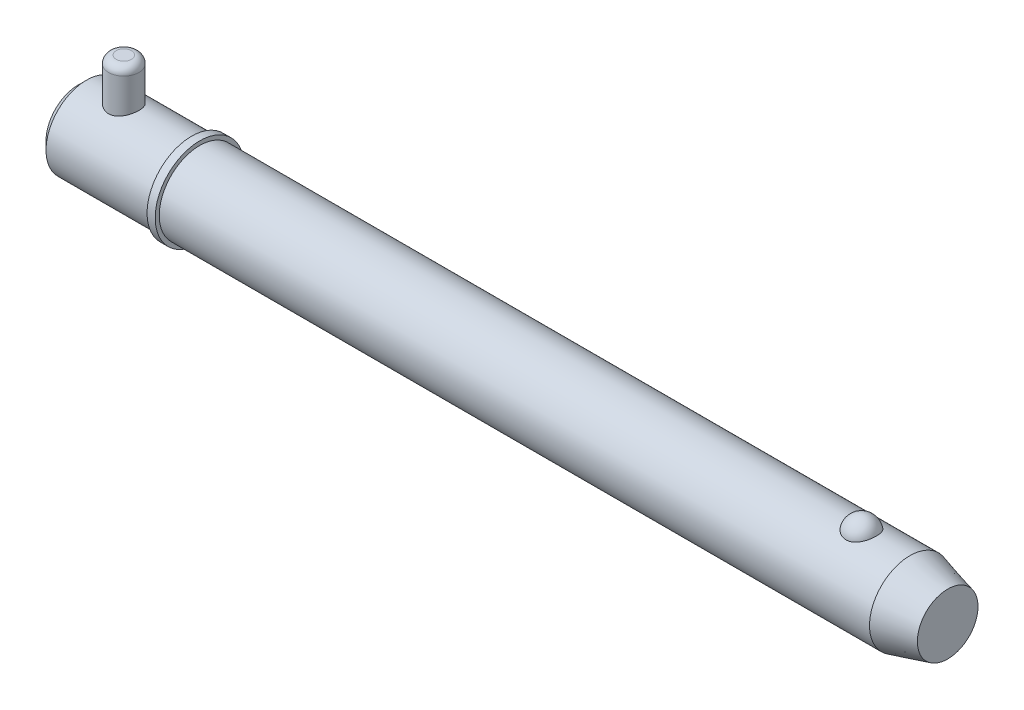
ISO-10303-21;
HEADER;
FILE_DESCRIPTION(('STEP AP214'),'2;1');
FILE_NAME('part.step','',(''),(''),'','','');
FILE_SCHEMA(('AUTOMOTIVE_DESIGN { 1 0 10303 214 1 1 1 1 }'));
ENDSEC;
DATA;
#1=APPLICATION_CONTEXT('core data for automotive mechanical design processes');
#2=APPLICATION_PROTOCOL_DEFINITION('international standard','automotive_design',2000,#1);
#3=PRODUCT_CONTEXT('',#1,'mechanical');
#4=PRODUCT('Part','Part','',(#3));
#5=PRODUCT_RELATED_PRODUCT_CATEGORY('part','',(#4));
#6=PRODUCT_DEFINITION_FORMATION('','',#4);
#7=PRODUCT_DEFINITION_CONTEXT('part definition',#1,'design');
#8=PRODUCT_DEFINITION('design','',#6,#7);
#9=PRODUCT_DEFINITION_SHAPE('','',#8);
#10=(LENGTH_UNIT() NAMED_UNIT(*) SI_UNIT(.MILLI.,.METRE.));
#11=(NAMED_UNIT(*) PLANE_ANGLE_UNIT() SI_UNIT($,.RADIAN.));
#12=(NAMED_UNIT(*) SI_UNIT($,.STERADIAN.) SOLID_ANGLE_UNIT());
#13=UNCERTAINTY_MEASURE_WITH_UNIT(LENGTH_MEASURE(1.E-05),#10,'distance_accuracy_value','');
#14=(GEOMETRIC_REPRESENTATION_CONTEXT(3) GLOBAL_UNCERTAINTY_ASSIGNED_CONTEXT((#13)) GLOBAL_UNIT_ASSIGNED_CONTEXT((#10,
#11,#12)) REPRESENTATION_CONTEXT('',''));
#15=CARTESIAN_POINT('',(0.,0.,0.));
#16=DIRECTION('',(0.,0.,1.));
#17=DIRECTION('',(1.,0.,0.));
#18=AXIS2_PLACEMENT_3D('',#15,#16,#17);
#19=CARTESIAN_POINT('',(14.28,25.4,0.));
#20=DIRECTION('',(0.,-1.,0.));
#21=DIRECTION('',(0.,0.,-1.));
#22=AXIS2_PLACEMENT_3D('',#19,#20,#21);
#23=CYLINDRICAL_SURFACE('',#22,4.76);
#24=CARTESIAN_POINT('',(14.28,-10.32,0.));
#25=DIRECTION('',(0.,1.,0.));
#26=DIRECTION('',(0.,0.,1.));
#27=AXIS2_PLACEMENT_3D('',#24,#25,#26);
#28=CIRCLE('',#27,4.76);
#29=CARTESIAN_POINT('',(14.28,-10.32,-4.76));
#30=VERTEX_POINT('',#29);
#31=EDGE_CURVE('P0_E25',#30,#30,#28,.T.);
#32=CARTESIAN_POINT('',(14.28,23.02,0.));
#33=DIRECTION('',(0.,1.,0.));
#34=DIRECTION('',(0.,0.,1.));
#35=AXIS2_PLACEMENT_3D('',#32,#33,#34);
#36=CIRCLE('',#35,4.76);
#37=CARTESIAN_POINT('',(14.28,23.02,-4.76));
#38=VERTEX_POINT('',#37);
#39=EDGE_CURVE('P0_E29',#38,#38,#36,.F.);
#40=CARTESIAN_POINT('',(14.28,-10.32,-4.76));
#41=CARTESIAN_POINT('',(14.28,-9.97270833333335,-4.76));
#42=CARTESIAN_POINT('',(14.28,-9.62541666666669,-4.76));
#43=CARTESIAN_POINT('',(14.28,-8.93083333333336,-4.76));
#44=CARTESIAN_POINT('',(14.28,-8.58354166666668,-4.76));
#45=CARTESIAN_POINT('',(14.28,-7.88895833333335,-4.76));
#46=CARTESIAN_POINT('',(14.28,-7.54166666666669,-4.76));
#47=CARTESIAN_POINT('',(14.28,-6.84708333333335,-4.76));
#48=CARTESIAN_POINT('',(14.28,-6.49979166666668,-4.76));
#49=CARTESIAN_POINT('',(14.28,-5.80520833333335,-4.76));
#50=CARTESIAN_POINT('',(14.28,-5.45791666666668,-4.76));
#51=CARTESIAN_POINT('',(14.28,-4.76333333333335,-4.76));
#52=CARTESIAN_POINT('',(14.28,-4.41604166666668,-4.76));
#53=CARTESIAN_POINT('',(14.28,-3.72145833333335,-4.76));
#54=CARTESIAN_POINT('',(14.28,-3.37416666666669,-4.76));
#55=CARTESIAN_POINT('',(14.28,-2.67958333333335,-4.76));
#56=CARTESIAN_POINT('',(14.28,-2.33229166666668,-4.76));
#57=CARTESIAN_POINT('',(14.28,-1.63770833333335,-4.76));
#58=CARTESIAN_POINT('',(14.28,-1.29041666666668,-4.76));
#59=CARTESIAN_POINT('',(14.28,-0.595833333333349,-4.76));
#60=CARTESIAN_POINT('',(14.28,-0.24854166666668,-4.76));
#61=CARTESIAN_POINT('',(14.28,0.446041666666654,-4.76));
#62=CARTESIAN_POINT('',(14.28,0.793333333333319,-4.76));
#63=CARTESIAN_POINT('',(14.28,1.48791666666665,-4.76));
#64=CARTESIAN_POINT('',(14.28,1.83520833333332,-4.76));
#65=CARTESIAN_POINT('',(14.28,2.52979166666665,-4.76));
#66=CARTESIAN_POINT('',(14.28,2.87708333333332,-4.76));
#67=CARTESIAN_POINT('',(14.28,3.57166666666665,-4.76));
#68=CARTESIAN_POINT('',(14.28,3.91895833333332,-4.76));
#69=CARTESIAN_POINT('',(14.28,4.61354166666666,-4.76));
#70=CARTESIAN_POINT('',(14.28,4.96083333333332,-4.76));
#71=CARTESIAN_POINT('',(14.28,5.65541666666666,-4.76));
#72=CARTESIAN_POINT('',(14.28,6.00270833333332,-4.76));
#73=CARTESIAN_POINT('',(14.28,6.69729166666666,-4.76));
#74=CARTESIAN_POINT('',(14.28,7.04458333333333,-4.76));
#75=CARTESIAN_POINT('',(14.28,7.73916666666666,-4.76));
#76=CARTESIAN_POINT('',(14.28,8.08645833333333,-4.76));
#77=CARTESIAN_POINT('',(14.28,8.78104166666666,-4.76));
#78=CARTESIAN_POINT('',(14.28,9.12833333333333,-4.76));
#79=CARTESIAN_POINT('',(14.28,9.82291666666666,-4.76));
#80=CARTESIAN_POINT('',(14.28,10.1702083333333,-4.76));
#81=CARTESIAN_POINT('',(14.28,10.8647916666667,-4.76));
#82=CARTESIAN_POINT('',(14.28,11.2120833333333,-4.76));
#83=CARTESIAN_POINT('',(14.28,11.9066666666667,-4.76));
#84=CARTESIAN_POINT('',(14.28,12.2539583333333,-4.76));
#85=CARTESIAN_POINT('',(14.28,12.9485416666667,-4.76));
#86=CARTESIAN_POINT('',(14.28,13.2958333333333,-4.76));
#87=CARTESIAN_POINT('',(14.28,13.9904166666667,-4.76));
#88=CARTESIAN_POINT('',(14.28,14.3377083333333,-4.76));
#89=CARTESIAN_POINT('',(14.28,15.0322916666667,-4.76));
#90=CARTESIAN_POINT('',(14.28,15.3795833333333,-4.76));
#91=CARTESIAN_POINT('',(14.28,16.0741666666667,-4.76));
#92=CARTESIAN_POINT('',(14.28,16.4214583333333,-4.76));
#93=CARTESIAN_POINT('',(14.28,17.1160416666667,-4.76));
#94=CARTESIAN_POINT('',(14.28,17.4633333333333,-4.76));
#95=CARTESIAN_POINT('',(14.28,18.1579166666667,-4.76));
#96=CARTESIAN_POINT('',(14.28,18.5052083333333,-4.76));
#97=CARTESIAN_POINT('',(14.28,19.1997916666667,-4.76));
#98=CARTESIAN_POINT('',(14.28,19.5470833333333,-4.76));
#99=CARTESIAN_POINT('',(14.28,20.2416666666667,-4.76));
#100=CARTESIAN_POINT('',(14.28,20.5889583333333,-4.76));
#101=CARTESIAN_POINT('',(14.28,21.2835416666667,-4.76));
#102=CARTESIAN_POINT('',(14.28,21.6308333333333,-4.76));
#103=CARTESIAN_POINT('',(14.28,22.3254166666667,-4.76));
#104=CARTESIAN_POINT('',(14.28,22.6727083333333,-4.76));
#105=CARTESIAN_POINT('',(14.28,23.02,-4.76));
#106=B_SPLINE_CURVE_WITH_KNOTS('',3,(#40,#41,#42,#43,#44,#45,#46,#47,#48,#49,#50,#51,#52,#53,
#54,#55,#56,#57,#58,#59,#60,#61,#62,#63,#64,#65,#66,#67,#68,#69,#70,#71,#72,#73,#74,#75,#76,#77,
#78,#79,#80,#81,#82,#83,#84,#85,#86,#87,#88,#89,#90,#91,#92,#93,#94,#95,#96,#97,#98,#99,#100,
#101,#102,#103,#104,#105),.UNSPECIFIED.,.F.,.F.,(4,2,2,2,2,2,2,2,2,2,2,2,2,2,2,2,2,2,2,2,2,2,2,
2,2,2,2,2,2,2,2,2,4),(0.,1.041875,2.08375,3.125625,4.1675,5.209375,6.25125,7.293125,
8.33500000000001,9.376875,10.41875,11.460625,12.5025,13.544375,14.58625,15.628125,16.67,
17.711875,18.75375,19.795625,20.8375,21.879375,22.92125,23.963125,25.005,26.046875,27.08875,
28.130625,29.1725,30.214375,31.25625,32.298125,33.34),.UNSPECIFIED.);
#107=EDGE_CURVE('P0_BSEAM14',#30,#38,#106,.T.);
#108=ORIENTED_EDGE('',*,*,#31,.T.);
#109=ORIENTED_EDGE('',*,*,#39,.T.);
#110=ORIENTED_EDGE('',*,*,#107,.T.);
#111=ORIENTED_EDGE('',*,*,#107,.F.);
#112=EDGE_LOOP('',(#108,#110,#109,#111));
#113=FACE_BOUND('',#112,.T.);
#114=ADVANCED_FACE('P0_F14',(#113),#23,.T.);
#115=CARTESIAN_POINT('',(14.28,25.4,0.));
#116=DIRECTION('',(0.,1.,0.));
#117=DIRECTION('',(0.,0.,1.));
#118=AXIS2_PLACEMENT_3D('',#115,#116,#117);
#119=PLANE('',#118);
#120=CARTESIAN_POINT('',(14.28,25.4,0.));
#121=DIRECTION('',(0.,1.,0.));
#122=DIRECTION('',(0.,0.,1.));
#123=AXIS2_PLACEMENT_3D('',#120,#121,#122);
#124=CIRCLE('',#123,2.38);
#125=CARTESIAN_POINT('',(14.28,25.4,2.38));
#126=VERTEX_POINT('',#125);
#127=EDGE_CURVE('P0_E10',#126,#126,#124,.T.);
#128=ORIENTED_EDGE('',*,*,#127,.T.);
#129=EDGE_LOOP('',(#128));
#130=FACE_BOUND('',#129,.T.);
#131=ADVANCED_FACE('P0_F46',(#130),#119,.T.);
#132=CARTESIAN_POINT('',(14.28,-12.7,0.));
#133=DIRECTION('',(0.,1.,0.));
#134=DIRECTION('',(0.,0.,1.));
#135=AXIS2_PLACEMENT_3D('',#132,#133,#134);
#136=PLANE('',#135);
#137=CARTESIAN_POINT('',(14.28,-12.7,0.));
#138=DIRECTION('',(0.,1.,0.));
#139=DIRECTION('',(0.,0.,1.));
#140=AXIS2_PLACEMENT_3D('',#137,#138,#139);
#141=CIRCLE('',#140,2.38);
#142=CARTESIAN_POINT('',(14.28,-12.7,2.38));
#143=VERTEX_POINT('',#142);
#144=EDGE_CURVE('P0_E21',#143,#143,#141,.F.);
#145=ORIENTED_EDGE('',*,*,#144,.T.);
#146=EDGE_LOOP('',(#145));
#147=FACE_BOUND('',#146,.T.);
#148=ADVANCED_FACE('P0_F43',(#147),#136,.F.);
#149=CARTESIAN_POINT('',(14.28,-10.32,0.));
#150=DIRECTION('',(0.,1.,0.));
#151=DIRECTION('',(0.,0.,1.));
#152=AXIS2_PLACEMENT_3D('',#149,#150,#151);
#153=DEGENERATE_TOROIDAL_SURFACE('',#152,2.38,2.38,.T.);
#154=ORIENTED_EDGE('',*,*,#144,.F.);
#155=EDGE_LOOP('',(#154));
#156=FACE_BOUND('',#155,.T.);
#157=ORIENTED_EDGE('',*,*,#31,.F.);
#158=EDGE_LOOP('',(#157));
#159=FACE_BOUND('',#158,.T.);
#160=ADVANCED_FACE('P0_F38',(#156,#159),#153,.T.);
#161=CARTESIAN_POINT('',(14.28,23.02,0.));
#162=DIRECTION('',(0.,1.,0.));
#163=DIRECTION('',(0.,0.,1.));
#164=AXIS2_PLACEMENT_3D('',#161,#162,#163);
#165=DEGENERATE_TOROIDAL_SURFACE('',#164,2.38,2.38,.T.);
#166=ORIENTED_EDGE('',*,*,#39,.F.);
#167=EDGE_LOOP('',(#166));
#168=FACE_BOUND('',#167,.T.);
#169=ORIENTED_EDGE('',*,*,#127,.F.);
#170=EDGE_LOOP('',(#169));
#171=FACE_BOUND('',#170,.T.);
#172=ADVANCED_FACE('P0_F16',(#168,#171),#165,.T.);
#173=CLOSED_SHELL('',(#114,#131,#148,#160,#172));
#174=MANIFOLD_SOLID_BREP('P0_B1',#173);
#175=CARTESIAN_POINT('',(0.,0.,0.));
#176=DIRECTION('',(1.,0.,0.));
#177=DIRECTION('',(0.,0.,-1.));
#178=AXIS2_PLACEMENT_3D('',#175,#176,#177);
#179=CYLINDRICAL_SURFACE('',#178,12.7);
#180=CARTESIAN_POINT('',(261.200738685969,0.,0.));
#181=DIRECTION('',(1.,0.,0.));
#182=DIRECTION('',(0.,0.,-1.));
#183=AXIS2_PLACEMENT_3D('',#180,#181,#182);
#184=CIRCLE('',#183,12.7);
#185=CARTESIAN_POINT('',(261.200738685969,0.,-12.7));
#186=VERTEX_POINT('',#185);
#187=EDGE_CURVE('P1_E81',#186,#186,#184,.T.);
#188=ORIENTED_EDGE('',*,*,#187,.F.);
#189=EDGE_LOOP('',(#188));
#190=FACE_BOUND('',#189,.T.);
#191=CARTESIAN_POINT('',(38.1,0.,0.));
#192=DIRECTION('',(1.,0.,0.));
#193=DIRECTION('',(0.,0.,-1.));
#194=AXIS2_PLACEMENT_3D('',#191,#192,#193);
#195=CIRCLE('',#194,12.7);
#196=CARTESIAN_POINT('',(38.1,0.,-12.7));
#197=VERTEX_POINT('',#196);
#198=EDGE_CURVE('P1_E85',#197,#197,#195,.T.);
#199=ORIENTED_EDGE('',*,*,#198,.T.);
#200=EDGE_LOOP('',(#199));
#201=FACE_BOUND('',#200,.T.);
#202=CARTESIAN_POINT('',(245.960042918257,11.7500437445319,4.81938502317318));
#203=CARTESIAN_POINT('',(245.835088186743,11.7500430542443,4.81938571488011));
#204=CARTESIAN_POINT('',(245.710144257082,11.7520975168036,4.81438658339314));
#205=CARTESIAN_POINT('',(245.461142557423,11.760253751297,4.79442904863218));
#206=CARTESIAN_POINT('',(245.337085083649,11.7663568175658,4.77946746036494));
#207=CARTESIAN_POINT('',(245.090901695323,11.7824262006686,4.7397141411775));
#208=CARTESIAN_POINT('',(244.968774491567,11.7923898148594,4.71492928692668));
#209=CARTESIAN_POINT('',(244.727187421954,11.8158938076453,4.65571340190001));
#210=CARTESIAN_POINT('',(244.60772859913,11.8294355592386,4.6212786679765));
#211=CARTESIAN_POINT('',(244.372557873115,11.8596812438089,4.54309502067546));
#212=CARTESIAN_POINT('',(244.256839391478,11.8763792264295,4.49936361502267));
#213=CARTESIAN_POINT('',(244.029653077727,11.9124878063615,4.40287235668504));
#214=CARTESIAN_POINT('',(243.918186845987,11.9318994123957,4.35010914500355));
#215=CARTESIAN_POINT('',(243.591278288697,11.9934256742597,4.17881316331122));
#216=CARTESIAN_POINT('',(243.383127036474,12.038858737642,4.04720756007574));
#217=CARTESIAN_POINT('',(242.985850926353,12.1352173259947,3.748564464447));
#218=CARTESIAN_POINT('',(242.797443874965,12.1862630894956,3.58061821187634));
#219=CARTESIAN_POINT('',(242.450521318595,12.2875163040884,3.21600758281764));
#220=CARTESIAN_POINT('',(242.292011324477,12.3377235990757,3.0193379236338));
#221=CARTESIAN_POINT('',(242.00168878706,12.4344923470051,2.592916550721));
#222=CARTESIAN_POINT('',(241.871376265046,12.4807925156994,2.36208286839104));
#223=CARTESIAN_POINT('',(241.649407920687,12.5623454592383,1.88070399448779));
#224=CARTESIAN_POINT('',(241.557755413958,12.5975972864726,1.63015711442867));
#225=CARTESIAN_POINT('',(241.414046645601,12.6538414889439,1.1129886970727));
#226=CARTESIAN_POINT('',(241.362499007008,12.6746503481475,0.846205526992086));
#227=CARTESIAN_POINT('',(241.301977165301,12.699153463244,0.307085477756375));
#228=CARTESIAN_POINT('',(241.293001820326,12.7028481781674,0.034748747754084));
#229=CARTESIAN_POINT('',(241.317731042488,12.6927785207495,-0.506073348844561));
#230=CARTESIAN_POINT('',(241.351189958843,12.6791146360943,-0.774571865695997));
#231=CARTESIAN_POINT('',(241.459687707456,12.635882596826,-1.30170246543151));
#232=CARTESIAN_POINT('',(241.53472729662,12.606314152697,-1.56033436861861));
#233=CARTESIAN_POINT('',(241.72500006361,12.5342328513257,-2.0608389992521));
#234=CARTESIAN_POINT('',(241.840287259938,12.4917026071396,-2.30268867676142));
#235=CARTESIAN_POINT('',(242.108704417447,12.3981123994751,-2.76259600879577));
#236=CARTESIAN_POINT('',(242.261837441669,12.3470517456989,-2.98065173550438));
#237=CARTESIAN_POINT('',(242.603507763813,12.2416045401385,-3.38786328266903));
#238=CARTESIAN_POINT('',(242.792201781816,12.1872040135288,-3.57688418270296));
#239=CARTESIAN_POINT('',(243.200239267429,12.0814086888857,-3.91941073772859));
#240=CARTESIAN_POINT('',(243.419580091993,12.0300136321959,-4.07291945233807));
#241=CARTESIAN_POINT('',(243.878375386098,11.9373542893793,-4.33691289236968));
#242=CARTESIAN_POINT('',(244.117304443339,11.8958982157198,-4.44824125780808));
#243=CARTESIAN_POINT('',(244.61243761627,11.8268116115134,-4.62881985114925));
#244=CARTESIAN_POINT('',(244.868635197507,11.7991758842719,-4.69808589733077));
#245=CARTESIAN_POINT('',(245.377164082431,11.7622209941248,-4.78983181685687));
#246=CARTESIAN_POINT('',(245.629041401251,11.7520502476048,-4.81449025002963));
#247=CARTESIAN_POINT('',(246.133573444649,11.7485796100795,-4.82295735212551));
#248=CARTESIAN_POINT('',(246.386228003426,11.7552763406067,-4.80677420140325));
#249=CARTESIAN_POINT('',(246.876834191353,11.7842584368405,-4.73525430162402));
#250=CARTESIAN_POINT('',(247.114998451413,11.8060486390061,-4.68116061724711));
#251=CARTESIAN_POINT('',(247.578489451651,11.8622750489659,-4.53678133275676));
#252=CARTESIAN_POINT('',(247.803815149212,11.8967122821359,-4.44649279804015));
#253=CARTESIAN_POINT('',(248.240801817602,11.9754603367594,-4.2298761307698));
#254=CARTESIAN_POINT('',(248.452057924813,12.0199699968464,-4.10280539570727));
#255=CARTESIAN_POINT('',(248.850601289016,12.1138028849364,-3.81685409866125));
#256=CARTESIAN_POINT('',(249.037883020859,12.163127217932,-3.65796622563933));
#257=CARTESIAN_POINT('',(249.393350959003,12.2642343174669,-3.30364864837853));
#258=CARTESIAN_POINT('',(249.560111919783,12.3160165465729,-3.10678783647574));
#259=CARTESIAN_POINT('',(249.859579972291,12.4142566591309,-2.68748409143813));
#260=CARTESIAN_POINT('',(249.992280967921,12.4607135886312,-2.46503658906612));
#261=CARTESIAN_POINT('',(250.224691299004,12.5450236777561,-1.99289519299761));
#262=CARTESIAN_POINT('',(250.323215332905,12.5825557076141,-1.74255918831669));
#263=CARTESIAN_POINT('',(250.479227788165,12.6431720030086,-1.22773734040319));
#264=CARTESIAN_POINT('',(250.536715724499,12.6662560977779,-0.963251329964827));
#265=CARTESIAN_POINT('',(250.609544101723,12.6956486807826,-0.427355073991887));
#266=CARTESIAN_POINT('',(250.624837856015,12.7019385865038,-0.155937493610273));
#267=CARTESIAN_POINT('',(250.612779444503,12.6970201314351,0.385928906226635));
#268=CARTESIAN_POINT('',(250.58542805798,12.6858120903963,0.65637774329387));
#269=CARTESIAN_POINT('',(250.513060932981,12.6568455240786,1.05454017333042));
#270=CARTESIAN_POINT('',(250.483796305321,12.6451962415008,1.185778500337));
#271=CARTESIAN_POINT('',(250.415022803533,12.6181819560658,1.44513808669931));
#272=CARTESIAN_POINT('',(250.375517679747,12.6028183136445,1.57326046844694));
#273=CARTESIAN_POINT('',(250.286439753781,12.5687547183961,1.82554978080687));
#274=CARTESIAN_POINT('',(250.236862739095,12.5500533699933,1.9497150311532));
#275=CARTESIAN_POINT('',(250.12792115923,12.5098093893,2.1931437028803));
#276=CARTESIAN_POINT('',(250.068560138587,12.4882677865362,2.31240887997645));
#277=CARTESIAN_POINT('',(249.93997128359,12.4427679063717,2.54593031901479));
#278=CARTESIAN_POINT('',(249.870688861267,12.4187964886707,2.66015396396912));
#279=CARTESIAN_POINT('',(249.722903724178,12.3691892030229,2.88202659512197));
#280=CARTESIAN_POINT('',(249.644404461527,12.3435539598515,2.98967802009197));
#281=CARTESIAN_POINT('',(249.478550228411,12.2912955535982,3.19774385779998));
#282=CARTESIAN_POINT('',(249.391191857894,12.2646720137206,3.29815546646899));
#283=CARTESIAN_POINT('',(249.208161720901,12.2111945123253,3.49095035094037));
#284=CARTESIAN_POINT('',(249.112493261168,12.1843406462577,3.58333679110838));
#285=CARTESIAN_POINT('',(248.913627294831,12.1312249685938,3.75922876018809));
#286=CARTESIAN_POINT('',(248.810450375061,12.104961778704,3.84275713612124));
#287=CARTESIAN_POINT('',(248.597013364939,12.0537284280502,4.00056406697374));
#288=CARTESIAN_POINT('',(248.486756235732,12.028757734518,4.07484645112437));
#289=CARTESIAN_POINT('',(248.259755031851,11.9808306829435,4.21367959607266));
#290=CARTESIAN_POINT('',(248.143006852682,11.9578756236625,4.27822410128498));
#291=CARTESIAN_POINT('',(247.90394258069,11.9147184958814,4.39698483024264));
#292=CARTESIAN_POINT('',(247.781628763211,11.894515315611,4.45120522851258));
#293=CARTESIAN_POINT('',(247.522952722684,11.8561129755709,4.55255353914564));
#294=CARTESIAN_POINT('',(247.386223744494,11.8381764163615,4.59884858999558));
#295=CARTESIAN_POINT('',(247.108608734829,11.8069093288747,4.67853897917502));
#296=CARTESIAN_POINT('',(246.967724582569,11.7935767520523,4.71194005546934));
#297=CARTESIAN_POINT('',(246.68309446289,11.7720277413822,4.76552188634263));
#298=CARTESIAN_POINT('',(246.539348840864,11.7638106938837,4.78570422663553));
#299=CARTESIAN_POINT('',(246.250411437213,11.7528195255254,4.81263433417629));
#300=CARTESIAN_POINT('',(246.105219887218,11.7500445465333,4.81938421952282));
#301=CARTESIAN_POINT('',(245.960042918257,11.7500437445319,4.81938502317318));
#302=B_SPLINE_CURVE_WITH_KNOTS('',3,(#202,#203,#204,#205,#206,#207,#208,#209,#210,#211,#212,
#213,#214,#215,#216,#217,#218,#219,#220,#221,#222,#223,#224,#225,#226,#227,#228,#229,#230,#231,
#232,#233,#234,#235,#236,#237,#238,#239,#240,#241,#242,#243,#244,#245,#246,#247,#248,#249,#250,
#251,#252,#253,#254,#255,#256,#257,#258,#259,#260,#261,#262,#263,#264,#265,#266,#267,#268,#269,
#270,#271,#272,#273,#274,#275,#276,#277,#278,#279,#280,#281,#282,#283,#284,#285,#286,#287,#288,
#289,#290,#291,#292,#293,#294,#295,#296,#297,#298,#299,#300,#301),.UNSPECIFIED.,.T.,.F.,(4,2,2,
2,2,2,2,2,2,2,2,2,2,2,2,2,2,2,2,2,2,2,2,2,2,2,2,2,2,2,2,2,2,2,2,2,2,2,2,2,2,2,2,2,2,2,2,2,2,4),
(0.,0.374729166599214,0.749578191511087,1.12416526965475,1.49889629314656,1.87292776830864,
2.24709865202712,2.99481328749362,3.76399449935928,4.53331735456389,5.3368391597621,
6.14042986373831,6.95405296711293,7.76765424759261,8.57656703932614,9.38549455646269,
10.1955119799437,11.0055949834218,11.8193353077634,12.6330054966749,13.4294141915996,
14.2255231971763,14.9815786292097,15.7374826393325,16.4696948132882,17.2019663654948,
17.9501979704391,18.6986017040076,19.484470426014,20.2704797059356,21.0815215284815,
21.8925729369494,22.7045213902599,23.5164550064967,23.9209608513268,24.3253187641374,
24.7298461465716,25.1342272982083,25.54092555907,25.9474719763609,26.3541750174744,
26.7607169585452,27.1661834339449,27.5714814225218,27.9770386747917,28.3824315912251,
28.8181206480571,29.2536155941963,29.6890582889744,30.1244323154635),.UNSPECIFIED.);
#303=CARTESIAN_POINT('',(245.960042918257,11.7500437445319,4.81938502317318));
#304=VERTEX_POINT('',#303);
#305=EDGE_CURVE('P1_E35',#304,#304,#302,.T.);
#306=ORIENTED_EDGE('',*,*,#305,.T.);
#307=EDGE_LOOP('',(#306));
#308=FACE_BOUND('',#307,.T.);
#309=ADVANCED_FACE('P1_F13',(#190,#201,#308),#179,.T.);
#310=CARTESIAN_POINT('',(0.,0.,0.));
#311=DIRECTION('',(-1.,0.,0.));
#312=DIRECTION('',(0.,0.,1.));
#313=AXIS2_PLACEMENT_3D('',#310,#311,#312);
#314=PLANE('',#313);
#315=CARTESIAN_POINT('',(0.,0.,0.));
#316=DIRECTION('',(1.,0.,0.));
#317=DIRECTION('',(0.,0.,-1.));
#318=AXIS2_PLACEMENT_3D('',#315,#316,#317);
#319=CIRCLE('',#318,10.16);
#320=CARTESIAN_POINT('',(0.,0.,-10.16));
#321=VERTEX_POINT('',#320);
#322=EDGE_CURVE('P1_E9',#321,#321,#319,.T.);
#323=ORIENTED_EDGE('',*,*,#322,.F.);
#324=EDGE_LOOP('',(#323));
#325=FACE_BOUND('',#324,.T.);
#326=ADVANCED_FACE('P1_F15',(#325),#314,.T.);
#327=CARTESIAN_POINT('',(2.53999999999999,0.,0.));
#328=DIRECTION('',(1.,0.,0.));
#329=DIRECTION('',(0.,0.,-1.));
#330=AXIS2_PLACEMENT_3D('',#327,#328,#329);
#331=CONICAL_SURFACE('',#330,12.7,0.78539816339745);
#332=ORIENTED_EDGE('',*,*,#322,.T.);
#333=EDGE_LOOP('',(#332));
#334=FACE_BOUND('',#333,.T.);
#335=CARTESIAN_POINT('',(2.53999999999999,0.,0.));
#336=DIRECTION('',(1.,0.,0.));
#337=DIRECTION('',(0.,0.,-1.));
#338=AXIS2_PLACEMENT_3D('',#335,#336,#337);
#339=CIRCLE('',#338,12.7);
#340=CARTESIAN_POINT('',(2.53999999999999,0.,-12.7));
#341=VERTEX_POINT('',#340);
#342=EDGE_CURVE('P1_E26',#341,#341,#339,.T.);
#343=ORIENTED_EDGE('',*,*,#342,.F.);
#344=EDGE_LOOP('',(#343));
#345=FACE_BOUND('',#344,.T.);
#346=ADVANCED_FACE('P1_F77',(#334,#345),#331,.T.);
#347=CARTESIAN_POINT('',(0.,0.,0.));
#348=DIRECTION('',(1.,0.,0.));
#349=DIRECTION('',(0.,0.,-1.));
#350=AXIS2_PLACEMENT_3D('',#347,#348,#349);
#351=CYLINDRICAL_SURFACE('',#350,12.7);
#352=CARTESIAN_POINT('',(14.28,-11.7742260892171,4.76));
#353=CARTESIAN_POINT('',(14.1514948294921,-11.7742255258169,4.76000061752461));
#354=CARTESIAN_POINT('',(14.0229980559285,-11.7763355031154,4.75479194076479));
#355=CARTESIAN_POINT('',(13.7669369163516,-11.7847043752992,4.73401198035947));
#356=CARTESIAN_POINT('',(13.6393728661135,-11.7909646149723,4.71843733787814));
#357=CARTESIAN_POINT('',(13.386226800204,-11.8074248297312,4.67709434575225));
#358=CARTESIAN_POINT('',(13.2606439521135,-11.8176231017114,4.65133040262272));
#359=CARTESIAN_POINT('',(13.0122434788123,-11.8416347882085,4.58985545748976));
#360=CARTESIAN_POINT('',(12.8894269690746,-11.8554496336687,4.55414051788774));
#361=CARTESIAN_POINT('',(12.6477622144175,-11.8862222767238,4.47320764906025));
#362=CARTESIAN_POINT('',(12.5289037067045,-11.9031710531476,4.4280169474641));
#363=CARTESIAN_POINT('',(12.2955059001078,-11.939736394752,4.32845291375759));
#364=CARTESIAN_POINT('',(12.1809682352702,-11.9593539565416,4.2740761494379));
#365=CARTESIAN_POINT('',(11.8448901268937,-12.0213893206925,4.09777237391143));
#366=CARTESIAN_POINT('',(11.6307077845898,-12.0670135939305,3.9626122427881));
#367=CARTESIAN_POINT('',(11.2179129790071,-12.1641514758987,3.65386230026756));
#368=CARTESIAN_POINT('',(11.0204399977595,-12.2158379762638,3.47881300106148));
#369=CARTESIAN_POINT('',(10.6568212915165,-12.3178468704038,3.09829182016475));
#370=CARTESIAN_POINT('',(10.4906822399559,-12.3681689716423,2.89281347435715));
#371=CARTESIAN_POINT('',(10.1890299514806,-12.4638367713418,2.44867909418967));
#372=CARTESIAN_POINT('',(10.054749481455,-12.5089552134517,2.20913281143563));
#373=CARTESIAN_POINT('',(9.82886079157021,-12.5870472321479,1.70885919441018));
#374=CARTESIAN_POINT('',(9.73723778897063,-12.620025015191,1.44813923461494));
#375=CARTESIAN_POINT('',(9.60324488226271,-12.6688874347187,0.9248423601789));
#376=CARTESIAN_POINT('',(9.55892269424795,-12.6854474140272,0.662829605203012));
#377=CARTESIAN_POINT('',(9.5145335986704,-12.7020320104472,0.134596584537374));
#378=CARTESIAN_POINT('',(9.5144523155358,-12.7020619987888,-0.131622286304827));
#379=CARTESIAN_POINT('',(9.55741019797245,-12.6860129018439,-0.646717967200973));
#380=CARTESIAN_POINT('',(9.59831845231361,-12.6707298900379,-0.895801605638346));
#381=CARTESIAN_POINT('',(9.71850987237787,-12.6268158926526,-1.38327219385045));
#382=CARTESIAN_POINT('',(9.79779575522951,-12.5981839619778,-1.62165838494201));
#383=CARTESIAN_POINT('',(9.99348296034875,-12.5298894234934,-2.08508424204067));
#384=CARTESIAN_POINT('',(10.110407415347,-12.4900724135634,-2.30987931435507));
#385=CARTESIAN_POINT('',(10.3775896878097,-12.4034373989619,-2.7372158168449));
#386=CARTESIAN_POINT('',(10.5278582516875,-12.3566171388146,-2.93975004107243));
#387=CARTESIAN_POINT('',(10.8677318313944,-12.257571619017,-3.32936830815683));
#388=CARTESIAN_POINT('',(11.0591227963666,-12.2051903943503,-3.51485714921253));
#389=CARTESIAN_POINT('',(11.4706087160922,-12.1031155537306,-3.85170663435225));
#390=CARTESIAN_POINT('',(11.6907108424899,-12.0534226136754,-4.00305872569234));
#391=CARTESIAN_POINT('',(12.1596597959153,-11.9613684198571,-4.27038218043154));
#392=CARTESIAN_POINT('',(12.4090353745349,-11.9191939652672,-4.38549550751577));
#393=CARTESIAN_POINT('',(12.9256290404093,-11.8491124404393,-4.57149117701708));
#394=CARTESIAN_POINT('',(13.1928371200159,-11.8211974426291,-4.64239810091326));
#395=CARTESIAN_POINT('',(13.7217488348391,-11.7846654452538,-4.73434137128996));
#396=CARTESIAN_POINT('',(13.9829438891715,-11.7750694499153,-4.75791141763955));
#397=CARTESIAN_POINT('',(14.5056760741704,-11.7734909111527,-4.76182097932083));
#398=CARTESIAN_POINT('',(14.7672131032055,-11.7815039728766,-4.74217128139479));
#399=CARTESIAN_POINT('',(15.2702140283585,-11.8132466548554,-4.66249544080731));
#400=CARTESIAN_POINT('',(15.5120417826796,-11.8362133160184,-4.60442726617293));
#401=CARTESIAN_POINT('',(15.9824097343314,-11.8943704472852,-4.45202868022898));
#402=CARTESIAN_POINT('',(16.2109472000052,-11.9295634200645,-4.35769084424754));
#403=CARTESIAN_POINT('',(16.6577741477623,-12.0098310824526,-4.13144368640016));
#404=CARTESIAN_POINT('',(16.8753590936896,-12.055226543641,-3.99825937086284));
#405=CARTESIAN_POINT('',(17.2859732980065,-12.150238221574,-3.69949845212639));
#406=CARTESIAN_POINT('',(17.4789935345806,-12.19985597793,-3.5339100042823));
#407=CARTESIAN_POINT('',(17.8477707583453,-12.3015434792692,-3.1624728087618));
#408=CARTESIAN_POINT('',(18.0216609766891,-12.3535695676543,-2.95473880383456));
#409=CARTESIAN_POINT('',(18.254545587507,-12.426745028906,-2.62277433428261));
#410=CARTESIAN_POINT('',(18.3275489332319,-12.4503382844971,-2.50865480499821));
#411=CARTESIAN_POINT('',(18.463723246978,-12.4952713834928,-2.27428971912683));
#412=CARTESIAN_POINT('',(18.5268984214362,-12.5166121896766,-2.15404681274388));
#413=CARTESIAN_POINT('',(18.6427140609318,-12.5563817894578,-1.90858448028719));
#414=CARTESIAN_POINT('',(18.6953855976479,-12.5748191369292,-1.78338108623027));
#415=CARTESIAN_POINT('',(18.7899337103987,-12.6083284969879,-1.52857834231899));
#416=CARTESIAN_POINT('',(18.8318147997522,-12.6234019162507,-1.39898085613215));
#417=CARTESIAN_POINT('',(18.9043819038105,-12.6497495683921,-1.13633254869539));
#418=CARTESIAN_POINT('',(18.9350698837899,-12.6610244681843,-1.00328233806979));
#419=CARTESIAN_POINT('',(18.9849303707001,-12.6794412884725,-0.734761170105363));
#420=CARTESIAN_POINT('',(19.0041035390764,-12.6865834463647,-0.59929035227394));
#421=CARTESIAN_POINT('',(19.0299427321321,-12.6962286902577,-0.335006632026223));
#422=CARTESIAN_POINT('',(19.0372742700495,-12.698978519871,-0.206267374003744));
#423=CARTESIAN_POINT('',(19.0414668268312,-12.7005496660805,0.0514515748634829));
#424=CARTESIAN_POINT('',(19.038324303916,-12.69936965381,0.180431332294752));
#425=CARTESIAN_POINT('',(19.0215965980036,-12.6931114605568,0.437551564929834));
#426=CARTESIAN_POINT('',(19.0080165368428,-12.6880351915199,0.565692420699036));
#427=CARTESIAN_POINT('',(18.9705519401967,-12.6741222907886,0.820297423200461));
#428=CARTESIAN_POINT('',(18.9466635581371,-12.665284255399,0.946760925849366));
#429=CARTESIAN_POINT('',(18.8895279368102,-12.6443449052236,1.19395899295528));
#430=CARTESIAN_POINT('',(18.8565273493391,-12.6323299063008,1.3147578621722));
#431=CARTESIAN_POINT('',(18.781239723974,-12.6052503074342,1.55308888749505));
#432=CARTESIAN_POINT('',(18.738949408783,-12.5901846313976,1.67061987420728));
#433=CARTESIAN_POINT('',(18.5986461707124,-12.5409473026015,2.01714406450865));
#434=CARTESIAN_POINT('',(18.4871532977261,-12.502717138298,2.24027279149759));
#435=CARTESIAN_POINT('',(18.2262440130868,-12.4173042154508,2.6742599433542));
#436=CARTESIAN_POINT('',(18.0754310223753,-12.3698127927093,2.88420891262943));
#437=CARTESIAN_POINT('',(17.7421836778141,-12.271667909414,3.27675114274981));
#438=CARTESIAN_POINT('',(17.5597380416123,-12.2210133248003,3.45933459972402));
#439=CARTESIAN_POINT('',(17.2605468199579,-12.1452079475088,3.7138066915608));
#440=CARTESIAN_POINT('',(17.1535518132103,-12.119328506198,3.79719993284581));
#441=CARTESIAN_POINT('',(16.9326449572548,-12.0688597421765,3.95467398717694));
#442=CARTESIAN_POINT('',(16.8187356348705,-12.0442699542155,4.02875817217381));
#443=CARTESIAN_POINT('',(16.5846234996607,-11.9971053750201,4.16711104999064));
#444=CARTESIAN_POINT('',(16.4644172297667,-11.9745317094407,4.23137427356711));
#445=CARTESIAN_POINT('',(16.2185866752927,-11.9321360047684,4.34949041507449));
#446=CARTESIAN_POINT('',(16.09296473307,-11.9123127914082,4.40334777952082));
#447=CARTESIAN_POINT('',(15.8314769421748,-11.875268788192,4.50232278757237));
#448=CARTESIAN_POINT('',(15.6954035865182,-11.8582009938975,4.54695127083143));
#449=CARTESIAN_POINT('',(15.4194002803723,-11.8284328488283,4.62383807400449));
#450=CARTESIAN_POINT('',(15.2794720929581,-11.815730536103,4.6561019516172));
#451=CARTESIAN_POINT('',(14.9969657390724,-11.7951940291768,4.70788444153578));
#452=CARTESIAN_POINT('',(14.8543884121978,-11.7873583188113,4.72740702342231));
#453=CARTESIAN_POINT('',(14.5678704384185,-11.7768749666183,4.75346370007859));
#454=CARTESIAN_POINT('',(14.4239299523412,-11.7742267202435,4.75999930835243));
#455=CARTESIAN_POINT('',(14.28,-11.7742260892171,4.76));
#456=B_SPLINE_CURVE_WITH_KNOTS('',3,(#352,#353,#354,#355,#356,#357,#358,#359,#360,#361,#362,
#363,#364,#365,#366,#367,#368,#369,#370,#371,#372,#373,#374,#375,#376,#377,#378,#379,#380,#381,
#382,#383,#384,#385,#386,#387,#388,#389,#390,#391,#392,#393,#394,#395,#396,#397,#398,#399,#400,
#401,#402,#403,#404,#405,#406,#407,#408,#409,#410,#411,#412,#413,#414,#415,#416,#417,#418,#419,
#420,#421,#422,#423,#424,#425,#426,#427,#428,#429,#430,#431,#432,#433,#434,#435,#436,#437,#438,
#439,#440,#441,#442,#443,#444,#445,#446,#447,#448,#449,#450,#451,#452,#453,#454,#455),
.UNSPECIFIED.,.T.,.F.,(4,2,2,2,2,2,2,2,2,2,2,2,2,2,2,2,2,2,2,2,2,2,2,2,2,2,2,2,2,2,2,2,2,2,2,2,
2,2,2,2,2,2,2,2,2,2,2,2,2,2,2,4),(0.,0.385378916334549,0.770882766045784,1.15622008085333,
1.54171009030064,1.92610725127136,2.31064835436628,3.07917291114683,3.88239385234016,
4.68578566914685,5.51648193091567,6.34689010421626,7.14151420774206,7.93588010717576,
8.69098665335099,9.44614666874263,10.2122918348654,10.9786842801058,11.789876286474,
12.6012713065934,13.4306405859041,14.2595482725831,15.0427613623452,15.8257790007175,
16.5716820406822,17.3177378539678,18.0917395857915,18.8660247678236,19.6893332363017,
20.1014571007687,20.5134040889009,20.9241137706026,21.3346513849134,21.7451168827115,
22.1555587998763,22.542011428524,22.928594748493,23.3149884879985,23.7015265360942,
24.0784835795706,24.4555738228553,25.2091300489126,25.994347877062,26.7798463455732,
27.1937428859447,27.6074890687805,28.0214648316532,28.4352633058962,28.8672794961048,
29.299101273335,29.7307884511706,30.1624253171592),.UNSPECIFIED.);
#457=CARTESIAN_POINT('',(14.28,-11.7742260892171,4.76));
#458=VERTEX_POINT('',#457);
#459=EDGE_CURVE('P1_E17',#458,#458,#456,.T.);
#460=ORIENTED_EDGE('',*,*,#459,.F.);
#461=EDGE_LOOP('',(#460));
#462=FACE_BOUND('',#461,.T.);
#463=CARTESIAN_POINT('',(14.28,11.7742260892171,4.76));
#464=CARTESIAN_POINT('',(14.4085051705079,11.7742255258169,4.76000061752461));
#465=CARTESIAN_POINT('',(14.5370019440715,11.7763355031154,4.75479194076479));
#466=CARTESIAN_POINT('',(14.7930630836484,11.7847043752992,4.73401198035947));
#467=CARTESIAN_POINT('',(14.9206271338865,11.7909646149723,4.71843733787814));
#468=CARTESIAN_POINT('',(15.173773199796,11.8074248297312,4.67709434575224));
#469=CARTESIAN_POINT('',(15.2993560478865,11.8176231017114,4.65133040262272));
#470=CARTESIAN_POINT('',(15.5477565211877,11.8416347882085,4.58985545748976));
#471=CARTESIAN_POINT('',(15.6705730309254,11.8554496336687,4.55414051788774));
#472=CARTESIAN_POINT('',(15.9122377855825,11.8862222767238,4.47320764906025));
#473=CARTESIAN_POINT('',(16.0310962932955,11.9031710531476,4.4280169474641));
#474=CARTESIAN_POINT('',(16.2644940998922,11.939736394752,4.32845291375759));
#475=CARTESIAN_POINT('',(16.3790317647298,11.9593539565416,4.2740761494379));
#476=CARTESIAN_POINT('',(16.7151098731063,12.0213893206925,4.09777237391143));
#477=CARTESIAN_POINT('',(16.9292922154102,12.0670135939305,3.96261224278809));
#478=CARTESIAN_POINT('',(17.3420870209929,12.1641514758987,3.65386230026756));
#479=CARTESIAN_POINT('',(17.5395600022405,12.2158379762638,3.47881300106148));
#480=CARTESIAN_POINT('',(17.9031787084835,12.3178468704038,3.09829182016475));
#481=CARTESIAN_POINT('',(18.0693177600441,12.3681689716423,2.89281347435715));
#482=CARTESIAN_POINT('',(18.3709700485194,12.4638367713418,2.44867909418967));
#483=CARTESIAN_POINT('',(18.505250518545,12.5089552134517,2.20913281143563));
#484=CARTESIAN_POINT('',(18.7311392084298,12.5870472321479,1.70885919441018));
#485=CARTESIAN_POINT('',(18.8227622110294,12.620025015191,1.44813923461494));
#486=CARTESIAN_POINT('',(18.9567551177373,12.6688874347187,0.924842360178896));
#487=CARTESIAN_POINT('',(19.0010773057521,12.6854474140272,0.662829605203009));
#488=CARTESIAN_POINT('',(19.0454664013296,12.7020320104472,0.134596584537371));
#489=CARTESIAN_POINT('',(19.0455476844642,12.7020619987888,-0.13162228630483));
#490=CARTESIAN_POINT('',(19.0025898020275,12.6860129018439,-0.646717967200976));
#491=CARTESIAN_POINT('',(18.9616815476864,12.6707298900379,-0.89580160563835));
#492=CARTESIAN_POINT('',(18.8414901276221,12.6268158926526,-1.38327219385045));
#493=CARTESIAN_POINT('',(18.7622042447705,12.5981839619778,-1.62165838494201));
#494=CARTESIAN_POINT('',(18.5665170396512,12.5298894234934,-2.08508424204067));
#495=CARTESIAN_POINT('',(18.449592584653,12.4900724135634,-2.30987931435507));
#496=CARTESIAN_POINT('',(18.1824103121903,12.4034373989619,-2.7372158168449));
#497=CARTESIAN_POINT('',(18.0321417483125,12.3566171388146,-2.93975004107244));
#498=CARTESIAN_POINT('',(17.6922681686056,12.257571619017,-3.32936830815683));
#499=CARTESIAN_POINT('',(17.5008772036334,12.2051903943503,-3.51485714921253));
#500=CARTESIAN_POINT('',(17.0893912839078,12.1031155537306,-3.85170663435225));
#501=CARTESIAN_POINT('',(16.8692891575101,12.0534226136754,-4.00305872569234));
#502=CARTESIAN_POINT('',(16.4003402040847,11.9613684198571,-4.27038218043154));
#503=CARTESIAN_POINT('',(16.1509646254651,11.9191939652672,-4.38549550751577));
#504=CARTESIAN_POINT('',(15.6343709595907,11.8491124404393,-4.57149117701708));
#505=CARTESIAN_POINT('',(15.367162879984,11.8211974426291,-4.64239810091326));
#506=CARTESIAN_POINT('',(14.8382511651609,11.7846654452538,-4.73434137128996));
#507=CARTESIAN_POINT('',(14.5770561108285,11.7750694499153,-4.75791141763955));
#508=CARTESIAN_POINT('',(14.0543239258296,11.7734909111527,-4.76182097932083));
#509=CARTESIAN_POINT('',(13.7927868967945,11.7815039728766,-4.74217128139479));
#510=CARTESIAN_POINT('',(13.2897859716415,11.8132466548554,-4.66249544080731));
#511=CARTESIAN_POINT('',(13.0479582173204,11.8362133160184,-4.60442726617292));
#512=CARTESIAN_POINT('',(12.5775902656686,11.8943704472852,-4.45202868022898));
#513=CARTESIAN_POINT('',(12.3490527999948,11.9295634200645,-4.35769084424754));
#514=CARTESIAN_POINT('',(11.9022258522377,12.0098310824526,-4.13144368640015));
#515=CARTESIAN_POINT('',(11.6846409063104,12.055226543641,-3.99825937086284));
#516=CARTESIAN_POINT('',(11.2740267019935,12.150238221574,-3.69949845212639));
#517=CARTESIAN_POINT('',(11.0810064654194,12.19985597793,-3.5339100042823));
#518=CARTESIAN_POINT('',(10.7122292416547,12.3015434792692,-3.1624728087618));
#519=CARTESIAN_POINT('',(10.5383390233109,12.3535695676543,-2.95473880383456));
#520=CARTESIAN_POINT('',(10.305454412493,12.426745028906,-2.6227743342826));
#521=CARTESIAN_POINT('',(10.2324510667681,12.4503382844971,-2.50865480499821));
#522=CARTESIAN_POINT('',(10.096276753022,12.4952713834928,-2.27428971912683));
#523=CARTESIAN_POINT('',(10.0331015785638,12.5166121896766,-2.15404681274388));
#524=CARTESIAN_POINT('',(9.91728593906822,12.5563817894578,-1.90858448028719));
#525=CARTESIAN_POINT('',(9.8646144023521,12.5748191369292,-1.78338108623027));
#526=CARTESIAN_POINT('',(9.77006628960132,12.6083284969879,-1.52857834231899));
#527=CARTESIAN_POINT('',(9.72818520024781,12.6234019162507,-1.39898085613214));
#528=CARTESIAN_POINT('',(9.65561809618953,12.6497495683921,-1.13633254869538));
#529=CARTESIAN_POINT('',(9.62493011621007,12.6610244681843,-1.00328233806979));
#530=CARTESIAN_POINT('',(9.57506962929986,12.6794412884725,-0.734761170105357));
#531=CARTESIAN_POINT('',(9.55589646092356,12.6865834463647,-0.599290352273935));
#532=CARTESIAN_POINT('',(9.53005726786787,12.6962286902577,-0.335006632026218));
#533=CARTESIAN_POINT('',(9.52272572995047,12.698978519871,-0.20626737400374));
#534=CARTESIAN_POINT('',(9.51853317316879,12.7005496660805,0.0514515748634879));
#535=CARTESIAN_POINT('',(9.52167569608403,12.69936965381,0.180431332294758));
#536=CARTESIAN_POINT('',(9.53840340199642,12.6931114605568,0.43755156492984));
#537=CARTESIAN_POINT('',(9.55198346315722,12.6880351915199,0.565692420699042));
#538=CARTESIAN_POINT('',(9.58944805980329,12.6741222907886,0.820297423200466));
#539=CARTESIAN_POINT('',(9.61333644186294,12.665284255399,0.946760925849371));
#540=CARTESIAN_POINT('',(9.67047206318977,12.6443449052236,1.19395899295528));
#541=CARTESIAN_POINT('',(9.7034726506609,12.6323299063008,1.31475786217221));
#542=CARTESIAN_POINT('',(9.77876027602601,12.6052503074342,1.55308888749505));
#543=CARTESIAN_POINT('',(9.82105059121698,12.5901846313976,1.67061987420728));
#544=CARTESIAN_POINT('',(9.96135382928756,12.5409473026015,2.01714406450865));
#545=CARTESIAN_POINT('',(10.0728467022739,12.502717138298,2.24027279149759));
#546=CARTESIAN_POINT('',(10.3337559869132,12.4173042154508,2.6742599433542));
#547=CARTESIAN_POINT('',(10.4845689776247,12.3698127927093,2.88420891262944));
#548=CARTESIAN_POINT('',(10.8178163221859,12.271667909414,3.27675114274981));
#549=CARTESIAN_POINT('',(11.0002619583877,12.2210133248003,3.45933459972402));
#550=CARTESIAN_POINT('',(11.2994531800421,12.1452079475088,3.7138066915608));
#551=CARTESIAN_POINT('',(11.4064481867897,12.119328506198,3.79719993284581));
#552=CARTESIAN_POINT('',(11.6273550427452,12.0688597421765,3.95467398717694));
#553=CARTESIAN_POINT('',(11.7412643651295,12.0442699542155,4.02875817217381));
#554=CARTESIAN_POINT('',(11.9753765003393,11.9971053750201,4.16711104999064));
#555=CARTESIAN_POINT('',(12.0955827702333,11.9745317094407,4.23137427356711));
#556=CARTESIAN_POINT('',(12.3414133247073,11.9321360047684,4.34949041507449));
#557=CARTESIAN_POINT('',(12.46703526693,11.9123127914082,4.40334777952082));
#558=CARTESIAN_POINT('',(12.7285230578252,11.875268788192,4.50232278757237));
#559=CARTESIAN_POINT('',(12.8645964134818,11.8582009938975,4.54695127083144));
#560=CARTESIAN_POINT('',(13.1405997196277,11.8284328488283,4.62383807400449));
#561=CARTESIAN_POINT('',(13.2805279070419,11.815730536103,4.6561019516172));
#562=CARTESIAN_POINT('',(13.5630342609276,11.7951940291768,4.70788444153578));
#563=CARTESIAN_POINT('',(13.7056115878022,11.7873583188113,4.72740702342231));
#564=CARTESIAN_POINT('',(13.9921295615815,11.7768749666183,4.75346370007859));
#565=CARTESIAN_POINT('',(14.1360700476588,11.7742267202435,4.75999930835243));
#566=CARTESIAN_POINT('',(14.28,11.7742260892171,4.76));
#567=B_SPLINE_CURVE_WITH_KNOTS('',3,(#463,#464,#465,#466,#467,#468,#469,#470,#471,#472,#473,
#474,#475,#476,#477,#478,#479,#480,#481,#482,#483,#484,#485,#486,#487,#488,#489,#490,#491,#492,
#493,#494,#495,#496,#497,#498,#499,#500,#501,#502,#503,#504,#505,#506,#507,#508,#509,#510,#511,
#512,#513,#514,#515,#516,#517,#518,#519,#520,#521,#522,#523,#524,#525,#526,#527,#528,#529,#530,
#531,#532,#533,#534,#535,#536,#537,#538,#539,#540,#541,#542,#543,#544,#545,#546,#547,#548,#549,
#550,#551,#552,#553,#554,#555,#556,#557,#558,#559,#560,#561,#562,#563,#564,#565,#566),
.UNSPECIFIED.,.T.,.F.,(4,2,2,2,2,2,2,2,2,2,2,2,2,2,2,2,2,2,2,2,2,2,2,2,2,2,2,2,2,2,2,2,2,2,2,2,
2,2,2,2,2,2,2,2,2,2,2,2,2,2,2,4),(0.,0.385378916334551,0.770882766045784,1.15622008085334,
1.54171009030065,1.92610725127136,2.31064835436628,3.07917291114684,3.88239385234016,
4.68578566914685,5.51648193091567,6.34689010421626,7.14151420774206,7.93588010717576,
8.690986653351,9.44614666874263,10.2122918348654,10.9786842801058,11.789876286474,
12.6012713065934,13.4306405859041,14.2595482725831,15.0427613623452,15.8257790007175,
16.5716820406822,17.3177378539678,18.0917395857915,18.8660247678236,19.6893332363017,
20.1014571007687,20.5134040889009,20.9241137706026,21.3346513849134,21.7451168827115,
22.1555587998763,22.542011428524,22.928594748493,23.3149884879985,23.7015265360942,
24.0784835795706,24.4555738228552,25.2091300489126,25.994347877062,26.7798463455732,
27.1937428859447,27.6074890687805,28.0214648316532,28.4352633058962,28.8672794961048,
29.299101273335,29.7307884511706,30.1624253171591),.UNSPECIFIED.);
#568=CARTESIAN_POINT('',(14.28,11.7742260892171,4.76));
#569=VERTEX_POINT('',#568);
#570=EDGE_CURVE('P1_E43',#569,#569,#567,.T.);
#571=ORIENTED_EDGE('',*,*,#570,.F.);
#572=EDGE_LOOP('',(#571));
#573=FACE_BOUND('',#572,.T.);
#574=ORIENTED_EDGE('',*,*,#342,.T.);
#575=EDGE_LOOP('',(#574));
#576=FACE_BOUND('',#575,.T.);
#577=CARTESIAN_POINT('',(35.56,0.,0.));
#578=DIRECTION('',(1.,0.,0.));
#579=DIRECTION('',(0.,0.,-1.));
#580=AXIS2_PLACEMENT_3D('',#577,#578,#579);
#581=CIRCLE('',#580,12.7);
#582=CARTESIAN_POINT('',(35.56,0.,-12.7));
#583=VERTEX_POINT('',#582);
#584=EDGE_CURVE('P1_E31',#583,#583,#581,.T.);
#585=ORIENTED_EDGE('',*,*,#584,.F.);
#586=EDGE_LOOP('',(#585));
#587=FACE_BOUND('',#586,.T.);
#588=ADVANCED_FACE('P1_F103',(#462,#573,#576,#587),#351,.T.);
#589=CARTESIAN_POINT('',(35.56,12.7,0.));
#590=DIRECTION('',(-1.,0.,0.));
#591=DIRECTION('',(0.,0.,1.));
#592=AXIS2_PLACEMENT_3D('',#589,#590,#591);
#593=PLANE('',#592);
#594=ORIENTED_EDGE('',*,*,#584,.T.);
#595=EDGE_LOOP('',(#594));
#596=FACE_BOUND('',#595,.T.);
#597=CARTESIAN_POINT('',(35.56,0.,0.));
#598=DIRECTION('',(1.,0.,0.));
#599=DIRECTION('',(0.,0.,-1.));
#600=AXIS2_PLACEMENT_3D('',#597,#598,#599);
#601=CIRCLE('',#600,13.97);
#602=CARTESIAN_POINT('',(35.56,0.,-13.97));
#603=VERTEX_POINT('',#602);
#604=EDGE_CURVE('P1_E91',#603,#603,#601,.T.);
#605=ORIENTED_EDGE('',*,*,#604,.F.);
#606=EDGE_LOOP('',(#605));
#607=FACE_BOUND('',#606,.T.);
#608=ADVANCED_FACE('P1_F100',(#596,#607),#593,.T.);
#609=CARTESIAN_POINT('',(0.,0.,0.));
#610=DIRECTION('',(1.,0.,0.));
#611=DIRECTION('',(0.,0.,-1.));
#612=AXIS2_PLACEMENT_3D('',#609,#610,#611);
#613=CYLINDRICAL_SURFACE('',#612,13.97);
#614=ORIENTED_EDGE('',*,*,#604,.T.);
#615=EDGE_LOOP('',(#614));
#616=FACE_BOUND('',#615,.T.);
#617=CARTESIAN_POINT('',(38.1,0.,0.));
#618=DIRECTION('',(1.,0.,0.));
#619=DIRECTION('',(0.,0.,-1.));
#620=AXIS2_PLACEMENT_3D('',#617,#618,#619);
#621=CIRCLE('',#620,13.97);
#622=CARTESIAN_POINT('',(38.1,0.,-13.97));
#623=VERTEX_POINT('',#622);
#624=EDGE_CURVE('P1_E88',#623,#623,#621,.T.);
#625=ORIENTED_EDGE('',*,*,#624,.F.);
#626=EDGE_LOOP('',(#625));
#627=FACE_BOUND('',#626,.T.);
#628=ADVANCED_FACE('P1_F68',(#616,#627),#613,.T.);
#629=CARTESIAN_POINT('',(38.1,13.97,0.));
#630=DIRECTION('',(1.,0.,0.));
#631=DIRECTION('',(0.,0.,-1.));
#632=AXIS2_PLACEMENT_3D('',#629,#630,#631);
#633=PLANE('',#632);
#634=ORIENTED_EDGE('',*,*,#624,.T.);
#635=EDGE_LOOP('',(#634));
#636=FACE_BOUND('',#635,.T.);
#637=ORIENTED_EDGE('',*,*,#198,.F.);
#638=EDGE_LOOP('',(#637));
#639=FACE_BOUND('',#638,.T.);
#640=ADVANCED_FACE('P1_F62',(#636,#639),#633,.T.);
#641=CARTESIAN_POINT('',(273.05,0.,0.));
#642=DIRECTION('',(-1.,0.,0.));
#643=DIRECTION('',(0.,0.,1.));
#644=AXIS2_PLACEMENT_3D('',#641,#642,#643);
#645=CONICAL_SURFACE('',#644,9.52500000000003,0.26179938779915);
#646=ORIENTED_EDGE('',*,*,#187,.T.);
#647=EDGE_LOOP('',(#646));
#648=FACE_BOUND('',#647,.T.);
#649=CARTESIAN_POINT('',(273.05,0.,0.));
#650=DIRECTION('',(1.,0.,0.));
#651=DIRECTION('',(0.,0.,-1.));
#652=AXIS2_PLACEMENT_3D('',#649,#650,#651);
#653=CIRCLE('',#652,9.52500000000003);
#654=CARTESIAN_POINT('',(273.05,0.,-9.52500000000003));
#655=VERTEX_POINT('',#654);
#656=EDGE_CURVE('P1_E42',#655,#655,#653,.T.);
#657=ORIENTED_EDGE('',*,*,#656,.F.);
#658=EDGE_LOOP('',(#657));
#659=FACE_BOUND('',#658,.T.);
#660=ADVANCED_FACE('P1_F59',(#648,#659),#645,.T.);
#661=CARTESIAN_POINT('',(273.05,9.52500000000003,0.));
#662=DIRECTION('',(1.,0.,0.));
#663=DIRECTION('',(0.,0.,-1.));
#664=AXIS2_PLACEMENT_3D('',#661,#662,#663);
#665=PLANE('',#664);
#666=ORIENTED_EDGE('',*,*,#656,.T.);
#667=EDGE_LOOP('',(#666));
#668=FACE_BOUND('',#667,.T.);
#669=ADVANCED_FACE('P1_F55',(#668),#665,.T.);
#670=CARTESIAN_POINT('',(245.960042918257,11.43,0.));
#671=DIRECTION('',(-1.,0.,0.));
#672=DIRECTION('',(0.,1.,0.));
#673=AXIS2_PLACEMENT_3D('',#670,#671,#672);
#674=SPHERICAL_SURFACE('',#673,4.83);
#675=ORIENTED_EDGE('',*,*,#305,.F.);
#676=EDGE_LOOP('',(#675));
#677=FACE_BOUND('',#676,.T.);
#678=ADVANCED_FACE('P1_F50',(#677),#674,.T.);
#679=CARTESIAN_POINT('',(14.28,-13.97,0.));
#680=DIRECTION('',(0.,1.,0.));
#681=DIRECTION('',(0.,0.,1.));
#682=AXIS2_PLACEMENT_3D('',#679,#680,#681);
#683=CYLINDRICAL_SURFACE('',#682,4.76);
#684=ORIENTED_EDGE('',*,*,#459,.T.);
#685=EDGE_LOOP('',(#684));
#686=FACE_BOUND('',#685,.T.);
#687=ORIENTED_EDGE('',*,*,#570,.T.);
#688=EDGE_LOOP('',(#687));
#689=FACE_BOUND('',#688,.T.);
#690=ADVANCED_FACE('P1_F54',(#686,#689),#683,.F.);
#691=CLOSED_SHELL('',(#309,#326,#346,#588,#608,#628,#640,#660,#669,#678,#690));
#692=MANIFOLD_SOLID_BREP('P1_B1',#691);
#693=ADVANCED_BREP_SHAPE_REPRESENTATION('',(#18,#174,#692),#14);
#694=SHAPE_DEFINITION_REPRESENTATION(#9,#693);
ENDSEC;
END-ISO-10303-21;
